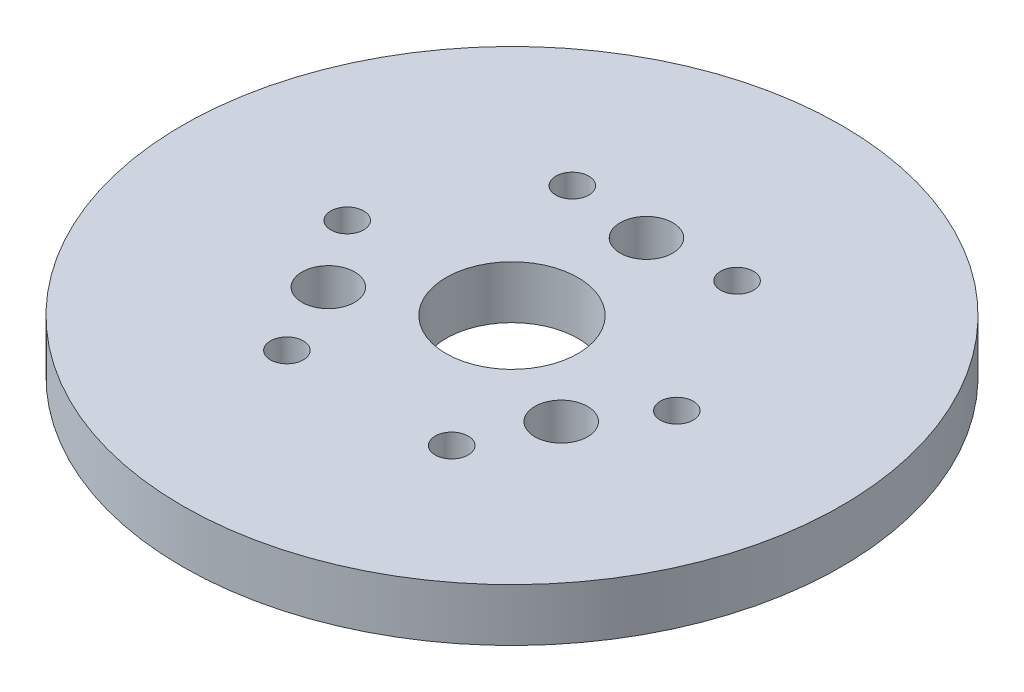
from build123d import *

# Parameters (mm, degrees)
SKETCH1_R           = 25
BOSS_EXTRUDE1_DEPTH = 4
SKETCH6_R           = 5
CUT_EXTRUDE3_DEPTH  = 20.7
SKETCH7_R           = 1.25
SKETCH7_R_2         = 2
CUT_EXTRUDE4_DEPTH  = 10


with BuildPart() as part:
    # Sketch1 → Boss-Extrude1 (new body)
    with BuildSketch(Plane(origin=(0, 0, 0), x_dir=(1, 0, 0), z_dir=(0, 1, 0))):
        with Locations(Location((0, 0, 0), (0, 0, 270))):
            Circle(SKETCH1_R)
    extrude(amount=BOSS_EXTRUDE1_DEPTH)

    # Sketch6 → Cut-Extrude3 (cut)
    with BuildSketch(Plane(origin=(0, 4, 0), x_dir=(1, 0, 0), z_dir=(0, 1, 0))):
        with Locations(Location((0, 0, 0), (0, 0, 270))):
            Circle(SKETCH6_R)
    extrude(amount=-CUT_EXTRUDE3_DEPTH, mode=Mode.SUBTRACT)

    # Sketch7 → Cut-Extrude4 (cut)
    with BuildSketch(Plane(origin=(0, 4, 0), x_dir=(1, 0, 0), z_dir=(0, 1, 0))):
        with Locations(Location((-6.25, 10.825317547, 0), (0, 0, 270))):
            Circle(SKETCH7_R)
        with Locations(Location((6.25, 10.825317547, 0), (0, 0, 270))):
            Circle(SKETCH7_R)
        with Locations(Location((12.5, 0, 0), (0, 0, 270))):
            Circle(SKETCH7_R)
        with Locations(Location((6.25, -10.825317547, 0), (0, 0, 270))):
            Circle(SKETCH7_R)
        with Locations(Location((-6.25, -10.825317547, 0), (0, 0, 270))):
            Circle(SKETCH7_R)
        with Locations(Location((-12.5, 0, 0), (0, 0, 270))):
            Circle(SKETCH7_R)
        with Locations(Location((0, 10.2, 0), (0, 0, 270))):
            Circle(SKETCH7_R_2)
        with Locations(Location((8.833459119, -5.1, 0), (0, 0, 270))):
            Circle(SKETCH7_R_2)
        with Locations(Location((-8.833459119, -5.1, 0), (0, 0, 270))):
            Circle(SKETCH7_R_2)
    extrude(amount=-CUT_EXTRUDE4_DEPTH, mode=Mode.SUBTRACT)


solid = part.part
